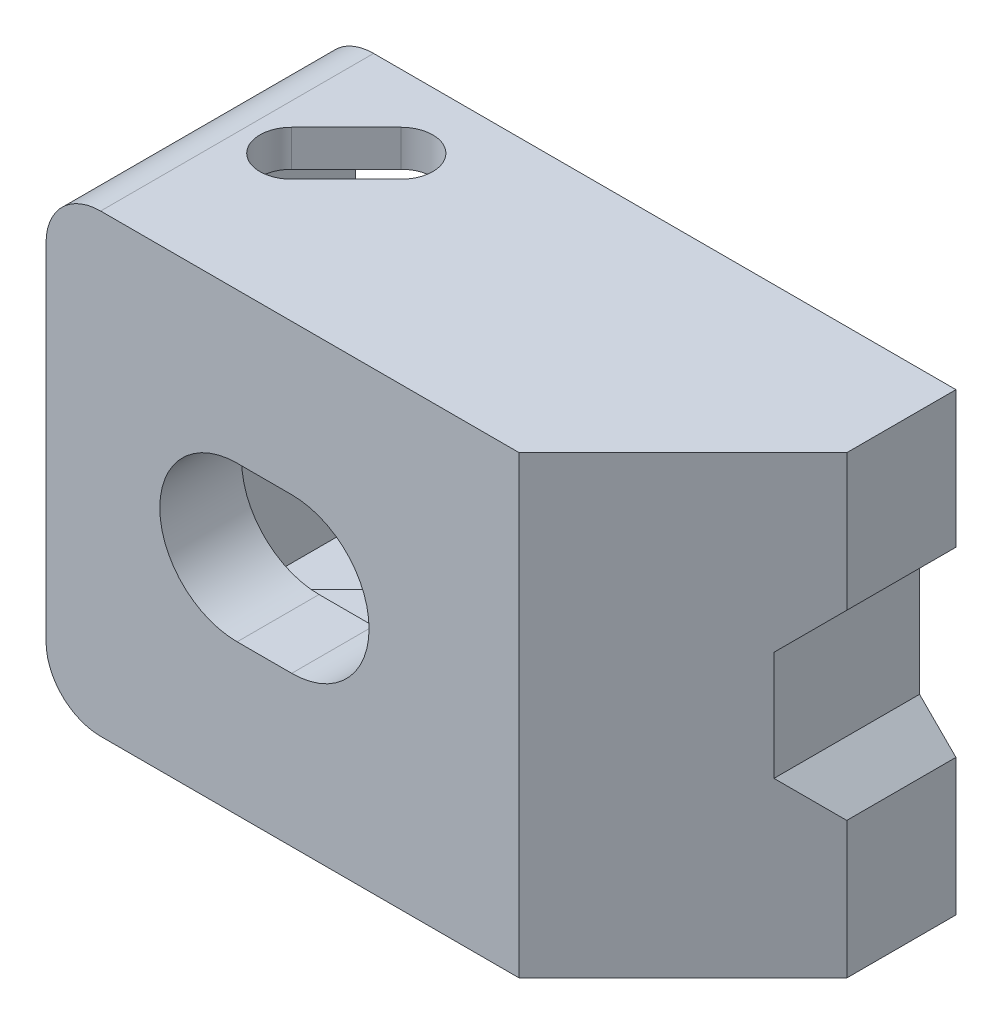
ISO-10303-21;
HEADER;
FILE_DESCRIPTION(('STEP AP214'),'2;1');
FILE_NAME('part.step','',(''),(''),'','','');
FILE_SCHEMA(('AUTOMOTIVE_DESIGN { 1 0 10303 214 1 1 1 1 }'));
ENDSEC;
DATA;
#1=APPLICATION_CONTEXT('core data for automotive mechanical design processes');
#2=APPLICATION_PROTOCOL_DEFINITION('international standard','automotive_design',2000,#1);
#3=PRODUCT_CONTEXT('',#1,'mechanical');
#4=PRODUCT('Part','Part','',(#3));
#5=PRODUCT_RELATED_PRODUCT_CATEGORY('part','',(#4));
#6=PRODUCT_DEFINITION_FORMATION('','',#4);
#7=PRODUCT_DEFINITION_CONTEXT('part definition',#1,'design');
#8=PRODUCT_DEFINITION('design','',#6,#7);
#9=PRODUCT_DEFINITION_SHAPE('','',#8);
#10=(LENGTH_UNIT() NAMED_UNIT(*) SI_UNIT(.MILLI.,.METRE.));
#11=(NAMED_UNIT(*) PLANE_ANGLE_UNIT() SI_UNIT($,.RADIAN.));
#12=(NAMED_UNIT(*) SI_UNIT($,.STERADIAN.) SOLID_ANGLE_UNIT());
#13=UNCERTAINTY_MEASURE_WITH_UNIT(LENGTH_MEASURE(1.E-05),#10,'distance_accuracy_value','');
#14=(GEOMETRIC_REPRESENTATION_CONTEXT(3) GLOBAL_UNCERTAINTY_ASSIGNED_CONTEXT((#13)) GLOBAL_UNIT_ASSIGNED_CONTEXT((#10,
#11,#12)) REPRESENTATION_CONTEXT('',''));
#15=CARTESIAN_POINT('',(0.,0.,0.));
#16=DIRECTION('',(0.,0.,1.));
#17=DIRECTION('',(1.,0.,0.));
#18=AXIS2_PLACEMENT_3D('',#15,#16,#17);
#19=CARTESIAN_POINT('',(18.5,-12.5,25.));
#20=DIRECTION('',(0.,1.,0.));
#21=DIRECTION('',(0.,0.,-1.));
#22=AXIS2_PLACEMENT_3D('',#19,#20,#21);
#23=PLANE('',#22);
#24=DIRECTION('',(1.,0.,0.));
#25=VECTOR('',#24,1.);
#26=CARTESIAN_POINT('',(0.500000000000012,-12.5,15.));
#27=LINE('',#26,#25);
#28=CARTESIAN_POINT('',(-10.5,-12.5,15.));
#29=VERTEX_POINT('',#28);
#30=CARTESIAN_POINT('',(12.5,-12.5,15.));
#31=VERTEX_POINT('',#30);
#32=EDGE_CURVE('E353',#29,#31,#27,.T.);
#33=ORIENTED_EDGE('',*,*,#32,.F.);
#34=DIRECTION('',(0.,0.,1.));
#35=VECTOR('',#34,1.);
#36=CARTESIAN_POINT('',(-10.5,-12.5,25.));
#37=LINE('',#36,#35);
#38=CARTESIAN_POINT('',(-10.5,-12.5,0.));
#39=VERTEX_POINT('',#38);
#40=EDGE_CURVE('E37',#29,#39,#37,.F.);
#41=ORIENTED_EDGE('',*,*,#40,.T.);
#42=DIRECTION('',(1.,0.,0.));
#43=VECTOR('',#42,1.);
#44=CARTESIAN_POINT('',(18.5,-12.5,0.));
#45=LINE('',#44,#43);
#46=CARTESIAN_POINT('',(21.5,-12.5,0.));
#47=VERTEX_POINT('',#46);
#48=EDGE_CURVE('E339',#39,#47,#45,.T.);
#49=ORIENTED_EDGE('',*,*,#48,.T.);
#50=DIRECTION('',(0.,0.,1.));
#51=VECTOR('',#50,1.);
#52=CARTESIAN_POINT('',(21.5,-12.5,-25.1793566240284));
#53=LINE('',#52,#51);
#54=CARTESIAN_POINT('',(21.5,-12.5,6.));
#55=VERTEX_POINT('',#54);
#56=EDGE_CURVE('E285',#47,#55,#53,.T.);
#57=ORIENTED_EDGE('',*,*,#56,.T.);
#58=DIRECTION('',(-0.707106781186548,0.,0.707106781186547));
#59=VECTOR('',#58,1.);
#60=CARTESIAN_POINT('',(21.5,-12.5,6.));
#61=LINE('',#60,#59);
#62=EDGE_CURVE('E271',#55,#31,#61,.T.);
#63=ORIENTED_EDGE('',*,*,#62,.T.);
#64=EDGE_LOOP('',(#33,#41,#49,#57,#63));
#65=FACE_BOUND('',#64,.T.);
#66=CARTESIAN_POINT('',(-8.,-12.5,7.));
#67=DIRECTION('',(0.,1.,0.));
#68=DIRECTION('',(0.,0.,-1.));
#69=AXIS2_PLACEMENT_3D('',#66,#67,#68);
#70=CIRCLE('',#69,1.75);
#71=CARTESIAN_POINT('',(-9.23743686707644,-12.5,5.76256313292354));
#72=VERTEX_POINT('',#71);
#73=CARTESIAN_POINT('',(-6.76256313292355,-12.5,8.23743686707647));
#74=VERTEX_POINT('',#73);
#75=EDGE_CURVE('E702',#72,#74,#70,.T.);
#76=ORIENTED_EDGE('',*,*,#75,.T.);
#77=DIRECTION('',(0.707106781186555,0.,-0.70710678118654));
#78=VECTOR('',#77,1.);
#79=CARTESIAN_POINT('',(-6.76256313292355,-12.5,8.23743686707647));
#80=LINE('',#79,#78);
#81=CARTESIAN_POINT('',(-3.76256313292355,-12.5,5.23743686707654));
#82=VERTEX_POINT('',#81);
#83=EDGE_CURVE('E689',#74,#82,#80,.T.);
#84=ORIENTED_EDGE('',*,*,#83,.T.);
#85=CARTESIAN_POINT('',(-5.,-12.5,4.00000000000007));
#86=DIRECTION('',(0.,1.,0.));
#87=DIRECTION('',(0.,0.,-1.));
#88=AXIS2_PLACEMENT_3D('',#85,#86,#87);
#89=CIRCLE('',#88,1.75);
#90=CARTESIAN_POINT('',(-6.23743686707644,-12.5,2.7625631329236));
#91=VERTEX_POINT('',#90);
#92=EDGE_CURVE('E694',#82,#91,#89,.T.);
#93=ORIENTED_EDGE('',*,*,#92,.T.);
#94=DIRECTION('',(-0.707106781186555,0.,0.707106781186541));
#95=VECTOR('',#94,1.);
#96=CARTESIAN_POINT('',(-9.23743686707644,-12.5,5.76256313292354));
#97=LINE('',#96,#95);
#98=EDGE_CURVE('E698',#91,#72,#97,.T.);
#99=ORIENTED_EDGE('',*,*,#98,.T.);
#100=EDGE_LOOP('',(#76,#84,#93,#99));
#101=FACE_BOUND('',#100,.T.);
#102=ADVANCED_FACE('F14',(#65,#101),#23,.F.);
#103=CARTESIAN_POINT('',(-11.5,-10.5,0.));
#104=DIRECTION('',(0.,1.,0.));
#105=DIRECTION('',(0.,0.,-1.));
#106=AXIS2_PLACEMENT_3D('',#103,#104,#105);
#107=PLANE('',#106);
#108=DIRECTION('',(-1.,0.,0.));
#109=VECTOR('',#108,1.);
#110=CARTESIAN_POINT('',(-11.5,-10.5,0.));
#111=LINE('',#110,#109);
#112=CARTESIAN_POINT('',(15.727922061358,-10.5,0.));
#113=VERTEX_POINT('',#112);
#114=CARTESIAN_POINT('',(-11.5,-10.5,0.));
#115=VERTEX_POINT('',#114);
#116=EDGE_CURVE('E370',#113,#115,#111,.T.);
#117=ORIENTED_EDGE('',*,*,#116,.T.);
#118=DIRECTION('',(0.,0.,1.));
#119=VECTOR('',#118,1.);
#120=CARTESIAN_POINT('',(-11.5,-10.5,12.));
#121=LINE('',#120,#119);
#122=CARTESIAN_POINT('',(-11.5,-10.5,12.));
#123=VERTEX_POINT('',#122);
#124=EDGE_CURVE('E379',#115,#123,#121,.T.);
#125=ORIENTED_EDGE('',*,*,#124,.T.);
#126=DIRECTION('',(1.,0.,0.));
#127=VECTOR('',#126,1.);
#128=CARTESIAN_POINT('',(-9.,-10.5,12.));
#129=LINE('',#128,#127);
#130=CARTESIAN_POINT('',(-9.,-10.5,12.));
#131=VERTEX_POINT('',#130);
#132=EDGE_CURVE('E384',#123,#131,#129,.T.);
#133=ORIENTED_EDGE('',*,*,#132,.T.);
#134=DIRECTION('',(0.70710678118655,0.,-0.707106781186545));
#135=VECTOR('',#134,1.);
#136=CARTESIAN_POINT('',(-3.,-10.5,6.));
#137=LINE('',#136,#135);
#138=CARTESIAN_POINT('',(-3.,-10.5,6.));
#139=VERTEX_POINT('',#138);
#140=EDGE_CURVE('E473',#131,#139,#137,.T.);
#141=ORIENTED_EDGE('',*,*,#140,.T.);
#142=DIRECTION('',(1.,0.,0.));
#143=VECTOR('',#142,1.);
#144=CARTESIAN_POINT('',(9.72792206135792,-10.5,6.));
#145=LINE('',#144,#143);
#146=CARTESIAN_POINT('',(9.72792206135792,-10.5,6.));
#147=VERTEX_POINT('',#146);
#148=EDGE_CURVE('E471',#139,#147,#145,.T.);
#149=ORIENTED_EDGE('',*,*,#148,.T.);
#150=DIRECTION('',(0.70710678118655,0.,-0.707106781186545));
#151=VECTOR('',#150,1.);
#152=CARTESIAN_POINT('',(15.727922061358,-10.5,0.));
#153=LINE('',#152,#151);
#154=EDGE_CURVE('E382',#147,#113,#153,.T.);
#155=ORIENTED_EDGE('',*,*,#154,.T.);
#156=EDGE_LOOP('',(#117,#125,#133,#141,#149,#155));
#157=FACE_BOUND('',#156,.T.);
#158=DIRECTION('',(-0.707106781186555,0.,0.70710678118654));
#159=VECTOR('',#158,1.);
#160=CARTESIAN_POINT('',(-5.0125631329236,-10.5,6.48743686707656));
#161=LINE('',#160,#159);
#162=CARTESIAN_POINT('',(-3.76256313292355,-10.5,5.23743686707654));
#163=VERTEX_POINT('',#162);
#164=CARTESIAN_POINT('',(-6.76256313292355,-10.5,8.23743686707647));
#165=VERTEX_POINT('',#164);
#166=EDGE_CURVE('E715',#163,#165,#161,.T.);
#167=ORIENTED_EDGE('',*,*,#166,.T.);
#168=CARTESIAN_POINT('',(-8.,-10.5,7.));
#169=DIRECTION('',(0.,1.,0.));
#170=DIRECTION('',(0.,0.,-1.));
#171=AXIS2_PLACEMENT_3D('',#168,#169,#170);
#172=CIRCLE('',#171,1.75);
#173=CARTESIAN_POINT('',(-9.23743686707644,-10.5,5.76256313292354));
#174=VERTEX_POINT('',#173);
#175=EDGE_CURVE('E718',#165,#174,#172,.F.);
#176=ORIENTED_EDGE('',*,*,#175,.T.);
#177=DIRECTION('',(0.707106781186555,0.,-0.707106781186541));
#178=VECTOR('',#177,1.);
#179=CARTESIAN_POINT('',(-7.48743686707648,-10.5,4.01256313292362));
#180=LINE('',#179,#178);
#181=CARTESIAN_POINT('',(-6.23743686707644,-10.5,2.7625631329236));
#182=VERTEX_POINT('',#181);
#183=EDGE_CURVE('E701',#174,#182,#180,.T.);
#184=ORIENTED_EDGE('',*,*,#183,.T.);
#185=CARTESIAN_POINT('',(-5.,-10.5,4.00000000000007));
#186=DIRECTION('',(0.,1.,0.));
#187=DIRECTION('',(0.,0.,-1.));
#188=AXIS2_PLACEMENT_3D('',#185,#186,#187);
#189=CIRCLE('',#188,1.75);
#190=EDGE_CURVE('E712',#182,#163,#189,.F.);
#191=ORIENTED_EDGE('',*,*,#190,.T.);
#192=EDGE_LOOP('',(#167,#176,#184,#191));
#193=FACE_BOUND('',#192,.T.);
#194=ADVANCED_FACE('F376',(#157,#193),#107,.T.);
#195=CARTESIAN_POINT('',(21.5,-12.5,-25.1793566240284));
#196=DIRECTION('',(1.,0.,0.));
#197=DIRECTION('',(0.,1.,0.));
#198=AXIS2_PLACEMENT_3D('',#195,#196,#197);
#199=PLANE('',#198);
#200=DIRECTION('',(0.,1.,0.));
#201=VECTOR('',#200,1.);
#202=CARTESIAN_POINT('',(21.5,-12.5,6.));
#203=LINE('',#202,#201);
#204=CARTESIAN_POINT('',(21.5,5.,6.));
#205=VERTEX_POINT('',#204);
#206=CARTESIAN_POINT('',(21.5,12.5,6.));
#207=VERTEX_POINT('',#206);
#208=EDGE_CURVE('E258',#205,#207,#203,.T.);
#209=ORIENTED_EDGE('',*,*,#208,.F.);
#210=DIRECTION('',(0.,0.,1.));
#211=VECTOR('',#210,1.);
#212=CARTESIAN_POINT('',(21.5,5.,-25.1793566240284));
#213=LINE('',#212,#211);
#214=CARTESIAN_POINT('',(21.5,5.,0.));
#215=VERTEX_POINT('',#214);
#216=EDGE_CURVE('E319',#215,#205,#213,.T.);
#217=ORIENTED_EDGE('',*,*,#216,.F.);
#218=DIRECTION('',(0.,-1.,0.));
#219=VECTOR('',#218,1.);
#220=CARTESIAN_POINT('',(21.5,-12.5,0.));
#221=LINE('',#220,#219);
#222=CARTESIAN_POINT('',(21.5,12.5,0.));
#223=VERTEX_POINT('',#222);
#224=EDGE_CURVE('E283',#223,#215,#221,.T.);
#225=ORIENTED_EDGE('',*,*,#224,.F.);
#226=DIRECTION('',(0.,0.,1.));
#227=VECTOR('',#226,1.);
#228=CARTESIAN_POINT('',(21.5,12.5,-25.1793566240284));
#229=LINE('',#228,#227);
#230=EDGE_CURVE('E276',#223,#207,#229,.T.);
#231=ORIENTED_EDGE('',*,*,#230,.T.);
#232=EDGE_LOOP('',(#209,#217,#225,#231));
#233=FACE_BOUND('',#232,.T.);
#234=ADVANCED_FACE('F281',(#233),#199,.T.);
#235=CARTESIAN_POINT('',(0.,0.,10.5));
#236=DIRECTION('',(0.,0.,-1.));
#237=DIRECTION('',(1.,0.,0.));
#238=AXIS2_PLACEMENT_3D('',#235,#236,#237);
#239=CYLINDRICAL_SURFACE('',#238,6.25);
#240=DIRECTION('',(0.,0.,-1.));
#241=VECTOR('',#240,1.);
#242=CARTESIAN_POINT('',(5.,3.75,10.5));
#243=LINE('',#242,#241);
#244=CARTESIAN_POINT('',(5.,3.75,10.5));
#245=VERTEX_POINT('',#244);
#246=CARTESIAN_POINT('',(5.,3.75,6.));
#247=VERTEX_POINT('',#246);
#248=EDGE_CURVE('E357',#245,#247,#243,.T.);
#249=ORIENTED_EDGE('',*,*,#248,.F.);
#250=CARTESIAN_POINT('',(0.,0.,10.5));
#251=DIRECTION('',(0.,0.,-1.));
#252=DIRECTION('',(1.,0.,0.));
#253=AXIS2_PLACEMENT_3D('',#250,#251,#252);
#254=CIRCLE('',#253,6.25);
#255=CARTESIAN_POINT('',(0.,6.25,10.5));
#256=VERTEX_POINT('',#255);
#257=EDGE_CURVE('E438',#256,#245,#254,.T.);
#258=ORIENTED_EDGE('',*,*,#257,.F.);
#259=DIRECTION('',(0.,0.,-1.));
#260=VECTOR('',#259,1.);
#261=CARTESIAN_POINT('',(0.,6.25,10.5));
#262=LINE('',#261,#260);
#263=CARTESIAN_POINT('',(0.,6.25,6.));
#264=VERTEX_POINT('',#263);
#265=EDGE_CURVE('E430',#256,#264,#262,.T.);
#266=ORIENTED_EDGE('',*,*,#265,.T.);
#267=CARTESIAN_POINT('',(0.,0.,6.));
#268=DIRECTION('',(0.,0.,1.));
#269=DIRECTION('',(-1.,0.,0.));
#270=AXIS2_PLACEMENT_3D('',#267,#268,#269);
#271=CIRCLE('',#270,6.25);
#272=EDGE_CURVE('E394',#264,#247,#271,.F.);
#273=ORIENTED_EDGE('',*,*,#272,.T.);
#274=EDGE_LOOP('',(#249,#258,#266,#273));
#275=FACE_BOUND('',#274,.T.);
#276=ADVANCED_FACE('F550',(#275),#239,.F.);
#277=DIRECTION('',(0.,0.,-1.));
#278=VECTOR('',#277,1.);
#279=CARTESIAN_POINT('',(5.,-3.75,10.5));
#280=LINE('',#279,#278);
#281=CARTESIAN_POINT('',(5.,-3.75,6.));
#282=VERTEX_POINT('',#281);
#283=CARTESIAN_POINT('',(5.,-3.75,10.5));
#284=VERTEX_POINT('',#283);
#285=EDGE_CURVE('E535',#282,#284,#280,.F.);
#286=ORIENTED_EDGE('',*,*,#285,.F.);
#287=CARTESIAN_POINT('',(0.,-6.25,6.));
#288=VERTEX_POINT('',#287);
#289=EDGE_CURVE('E397',#282,#288,#271,.F.);
#290=ORIENTED_EDGE('',*,*,#289,.T.);
#291=DIRECTION('',(0.,0.,-1.));
#292=VECTOR('',#291,1.);
#293=CARTESIAN_POINT('',(0.,-6.25,10.5));
#294=LINE('',#293,#292);
#295=CARTESIAN_POINT('',(0.,-6.25,10.5));
#296=VERTEX_POINT('',#295);
#297=EDGE_CURVE('E429',#296,#288,#294,.T.);
#298=ORIENTED_EDGE('',*,*,#297,.F.);
#299=EDGE_CURVE('E441',#284,#296,#254,.T.);
#300=ORIENTED_EDGE('',*,*,#299,.F.);
#301=EDGE_LOOP('',(#286,#290,#298,#300));
#302=FACE_BOUND('',#301,.T.);
#303=ADVANCED_FACE('F548',(#302),#239,.F.);
#304=CARTESIAN_POINT('',(9.72792206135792,-10.5,6.));
#305=DIRECTION('',(0.,0.,1.));
#306=DIRECTION('',(-1.,0.,0.));
#307=AXIS2_PLACEMENT_3D('',#304,#305,#306);
#308=PLANE('',#307);
#309=DIRECTION('',(1.,0.,0.));
#310=VECTOR('',#309,1.);
#311=CARTESIAN_POINT('',(9.72792206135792,3.75,6.));
#312=LINE('',#311,#310);
#313=CARTESIAN_POINT('',(9.72792206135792,3.75,6.));
#314=VERTEX_POINT('',#313);
#315=EDGE_CURVE('E360',#247,#314,#312,.T.);
#316=ORIENTED_EDGE('',*,*,#315,.F.);
#317=ORIENTED_EDGE('',*,*,#272,.F.);
#318=DIRECTION('',(1.,0.,0.));
#319=VECTOR('',#318,1.);
#320=CARTESIAN_POINT('',(-11.5,6.25,6.));
#321=LINE('',#320,#319);
#322=CARTESIAN_POINT('',(-3.,6.25,6.));
#323=VERTEX_POINT('',#322);
#324=EDGE_CURVE('E449',#323,#264,#321,.T.);
#325=ORIENTED_EDGE('',*,*,#324,.F.);
#326=DIRECTION('',(0.,1.,0.));
#327=VECTOR('',#326,1.);
#328=CARTESIAN_POINT('',(-3.,-10.5,6.));
#329=LINE('',#328,#327);
#330=CARTESIAN_POINT('',(-3.,10.5,6.));
#331=VERTEX_POINT('',#330);
#332=EDGE_CURVE('E461',#323,#331,#329,.T.);
#333=ORIENTED_EDGE('',*,*,#332,.T.);
#334=DIRECTION('',(1.,0.,0.));
#335=VECTOR('',#334,1.);
#336=CARTESIAN_POINT('',(9.72792206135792,10.5,6.));
#337=LINE('',#336,#335);
#338=CARTESIAN_POINT('',(9.72792206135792,10.5,6.));
#339=VERTEX_POINT('',#338);
#340=EDGE_CURVE('E387',#331,#339,#337,.T.);
#341=ORIENTED_EDGE('',*,*,#340,.T.);
#342=DIRECTION('',(0.,1.,0.));
#343=VECTOR('',#342,1.);
#344=CARTESIAN_POINT('',(9.72792206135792,-10.5,6.));
#345=LINE('',#344,#343);
#346=EDGE_CURVE('E465',#314,#339,#345,.T.);
#347=ORIENTED_EDGE('',*,*,#346,.F.);
#348=EDGE_LOOP('',(#316,#317,#325,#333,#341,#347));
#349=FACE_BOUND('',#348,.T.);
#350=ADVANCED_FACE('F496',(#349),#308,.F.);
#351=DIRECTION('',(-1.,0.,0.));
#352=VECTOR('',#351,1.);
#353=CARTESIAN_POINT('',(9.72792206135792,-3.75,6.));
#354=LINE('',#353,#352);
#355=CARTESIAN_POINT('',(9.72792206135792,-3.75,6.));
#356=VERTEX_POINT('',#355);
#357=EDGE_CURVE('E532',#356,#282,#354,.T.);
#358=ORIENTED_EDGE('',*,*,#357,.F.);
#359=EDGE_CURVE('E466',#147,#356,#345,.T.);
#360=ORIENTED_EDGE('',*,*,#359,.F.);
#361=ORIENTED_EDGE('',*,*,#148,.F.);
#362=CARTESIAN_POINT('',(-3.,-6.25,6.));
#363=VERTEX_POINT('',#362);
#364=EDGE_CURVE('E462',#139,#363,#329,.T.);
#365=ORIENTED_EDGE('',*,*,#364,.T.);
#366=DIRECTION('',(-1.,0.,0.));
#367=VECTOR('',#366,1.);
#368=CARTESIAN_POINT('',(-11.5,-6.25,6.));
#369=LINE('',#368,#367);
#370=EDGE_CURVE('E452',#288,#363,#369,.T.);
#371=ORIENTED_EDGE('',*,*,#370,.F.);
#372=ORIENTED_EDGE('',*,*,#289,.F.);
#373=EDGE_LOOP('',(#358,#360,#361,#365,#371,#372));
#374=FACE_BOUND('',#373,.T.);
#375=ADVANCED_FACE('F514',(#374),#308,.F.);
#376=CARTESIAN_POINT('',(15.727922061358,-10.5,0.));
#377=DIRECTION('',(0.707106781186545,0.,0.70710678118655));
#378=DIRECTION('',(-0.70710678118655,0.,0.707106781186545));
#379=AXIS2_PLACEMENT_3D('',#376,#377,#378);
#380=PLANE('',#379);
#381=DIRECTION('',(0.70710678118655,0.,-0.707106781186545));
#382=VECTOR('',#381,1.);
#383=CARTESIAN_POINT('',(15.727922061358,3.75,0.));
#384=LINE('',#383,#382);
#385=CARTESIAN_POINT('',(10.,3.75,5.72792206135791));
#386=VERTEX_POINT('',#385);
#387=EDGE_CURVE('E315',#314,#386,#384,.T.);
#388=ORIENTED_EDGE('',*,*,#387,.F.);
#389=ORIENTED_EDGE('',*,*,#346,.T.);
#390=DIRECTION('',(0.70710678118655,0.,-0.707106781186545));
#391=VECTOR('',#390,1.);
#392=CARTESIAN_POINT('',(15.727922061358,10.5,0.));
#393=LINE('',#392,#391);
#394=CARTESIAN_POINT('',(15.727922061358,10.5,0.));
#395=VERTEX_POINT('',#394);
#396=EDGE_CURVE('E383',#339,#395,#393,.T.);
#397=ORIENTED_EDGE('',*,*,#396,.T.);
#398=DIRECTION('',(0.,1.,0.));
#399=VECTOR('',#398,1.);
#400=CARTESIAN_POINT('',(15.727922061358,-10.5,0.));
#401=LINE('',#400,#399);
#402=EDGE_CURVE('E455',#113,#395,#401,.T.);
#403=ORIENTED_EDGE('',*,*,#402,.F.);
#404=ORIENTED_EDGE('',*,*,#154,.F.);
#405=ORIENTED_EDGE('',*,*,#359,.T.);
#406=DIRECTION('',(-0.70710678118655,0.,0.707106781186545));
#407=VECTOR('',#406,1.);
#408=CARTESIAN_POINT('',(15.727922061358,-3.75,0.));
#409=LINE('',#408,#407);
#410=CARTESIAN_POINT('',(10.,-3.75,5.72792206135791));
#411=VERTEX_POINT('',#410);
#412=EDGE_CURVE('E309',#411,#356,#409,.T.);
#413=ORIENTED_EDGE('',*,*,#412,.F.);
#414=CARTESIAN_POINT('',(10.,0.,5.72792206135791));
#415=DIRECTION('',(0.707106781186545,0.,0.70710678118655));
#416=DIRECTION('',(0.70710678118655,0.,-0.707106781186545));
#417=AXIS2_PLACEMENT_3D('',#414,#415,#416);
#418=ELLIPSE('',#417,5.30330085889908,3.75);
#419=EDGE_CURVE('E311',#386,#411,#418,.F.);
#420=ORIENTED_EDGE('',*,*,#419,.F.);
#421=EDGE_LOOP('',(#388,#389,#397,#403,#404,#405,#413,#420));
#422=FACE_BOUND('',#421,.T.);
#423=ADVANCED_FACE('F518',(#422),#380,.F.);
#424=CARTESIAN_POINT('',(18.5,12.5,0.));
#425=DIRECTION('',(0.,0.,1.));
#426=DIRECTION('',(-1.,0.,0.));
#427=AXIS2_PLACEMENT_3D('',#424,#425,#426);
#428=PLANE('',#427);
#429=ORIENTED_EDGE('',*,*,#48,.F.);
#430=CARTESIAN_POINT('',(-10.5,-9.5,0.));
#431=DIRECTION('',(0.,0.,1.));
#432=DIRECTION('',(-1.,0.,0.));
#433=AXIS2_PLACEMENT_3D('',#430,#431,#432);
#434=CIRCLE('',#433,3.);
#435=CARTESIAN_POINT('',(-13.5,-9.5,0.));
#436=VERTEX_POINT('',#435);
#437=EDGE_CURVE('E22',#39,#436,#434,.F.);
#438=ORIENTED_EDGE('',*,*,#437,.T.);
#439=DIRECTION('',(0.,-1.,0.));
#440=VECTOR('',#439,1.);
#441=CARTESIAN_POINT('',(-13.5,12.5,0.));
#442=LINE('',#441,#440);
#443=CARTESIAN_POINT('',(-13.5,9.5,0.));
#444=VERTEX_POINT('',#443);
#445=EDGE_CURVE('E290',#444,#436,#442,.T.);
#446=ORIENTED_EDGE('',*,*,#445,.F.);
#447=CARTESIAN_POINT('',(-10.5,9.5,0.));
#448=DIRECTION('',(0.,0.,1.));
#449=DIRECTION('',(-1.,0.,0.));
#450=AXIS2_PLACEMENT_3D('',#447,#448,#449);
#451=CIRCLE('',#450,3.);
#452=CARTESIAN_POINT('',(-10.5,12.5,0.));
#453=VERTEX_POINT('',#452);
#454=EDGE_CURVE('E29',#444,#453,#451,.F.);
#455=ORIENTED_EDGE('',*,*,#454,.T.);
#456=DIRECTION('',(-1.,0.,0.));
#457=VECTOR('',#456,1.);
#458=CARTESIAN_POINT('',(18.5,12.5,0.));
#459=LINE('',#458,#457);
#460=EDGE_CURVE('E401',#223,#453,#459,.T.);
#461=ORIENTED_EDGE('',*,*,#460,.F.);
#462=ORIENTED_EDGE('',*,*,#224,.T.);
#463=DIRECTION('',(-0.707106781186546,-0.707106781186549,0.));
#464=VECTOR('',#463,1.);
#465=CARTESIAN_POINT('',(23.75,7.25,0.));
#466=LINE('',#465,#464);
#467=CARTESIAN_POINT('',(19.5,3.,0.));
#468=VERTEX_POINT('',#467);
#469=EDGE_CURVE('E730',#215,#468,#466,.T.);
#470=ORIENTED_EDGE('',*,*,#469,.T.);
#471=DIRECTION('',(0.,-1.,0.));
#472=VECTOR('',#471,1.);
#473=CARTESIAN_POINT('',(19.5,12.5,0.));
#474=LINE('',#473,#472);
#475=CARTESIAN_POINT('',(19.5,-3.,0.));
#476=VERTEX_POINT('',#475);
#477=EDGE_CURVE('E733',#468,#476,#474,.T.);
#478=ORIENTED_EDGE('',*,*,#477,.T.);
#479=DIRECTION('',(0.707106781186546,-0.707106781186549,0.));
#480=VECTOR('',#479,1.);
#481=CARTESIAN_POINT('',(11.25,5.25,0.));
#482=LINE('',#481,#480);
#483=CARTESIAN_POINT('',(21.5,-5.,0.));
#484=VERTEX_POINT('',#483);
#485=EDGE_CURVE('E725',#476,#484,#482,.T.);
#486=ORIENTED_EDGE('',*,*,#485,.T.);
#487=EDGE_CURVE('E284',#484,#47,#221,.T.);
#488=ORIENTED_EDGE('',*,*,#487,.T.);
#489=EDGE_LOOP('',(#429,#438,#446,#455,#461,#462,#470,#478,#486,#488));
#490=FACE_BOUND('',#489,.T.);
#491=ORIENTED_EDGE('',*,*,#116,.F.);
#492=ORIENTED_EDGE('',*,*,#402,.T.);
#493=DIRECTION('',(-1.,0.,0.));
#494=VECTOR('',#493,1.);
#495=CARTESIAN_POINT('',(-11.5,10.5,0.));
#496=LINE('',#495,#494);
#497=CARTESIAN_POINT('',(-11.5,10.5,0.));
#498=VERTEX_POINT('',#497);
#499=EDGE_CURVE('E302',#395,#498,#496,.T.);
#500=ORIENTED_EDGE('',*,*,#499,.T.);
#501=DIRECTION('',(0.,-1.,0.));
#502=VECTOR('',#501,1.);
#503=CARTESIAN_POINT('',(-11.5,12.5,0.));
#504=LINE('',#503,#502);
#505=EDGE_CURVE('E347',#498,#115,#504,.T.);
#506=ORIENTED_EDGE('',*,*,#505,.T.);
#507=EDGE_LOOP('',(#491,#492,#500,#506));
#508=FACE_BOUND('',#507,.T.);
#509=ADVANCED_FACE('F337',(#490,#508),#428,.F.);
#510=CARTESIAN_POINT('',(-3.,0.,0.));
#511=DIRECTION('',(0.,0.,1.));
#512=DIRECTION('',(-1.,0.,0.));
#513=AXIS2_PLACEMENT_3D('',#510,#511,#512);
#514=CYLINDRICAL_SURFACE('',#513,4.25);
#515=CARTESIAN_POINT('',(-3.,0.,10.5));
#516=DIRECTION('',(0.,0.,-1.));
#517=DIRECTION('',(1.,0.,0.));
#518=AXIS2_PLACEMENT_3D('',#515,#516,#517);
#519=CIRCLE('',#518,4.25);
#520=CARTESIAN_POINT('',(-3.,4.25,10.5));
#521=VERTEX_POINT('',#520);
#522=CARTESIAN_POINT('',(-3.,-4.25,10.5));
#523=VERTEX_POINT('',#522);
#524=EDGE_CURVE('E423',#521,#523,#519,.F.);
#525=ORIENTED_EDGE('',*,*,#524,.F.);
#526=DIRECTION('',(0.,0.,1.));
#527=VECTOR('',#526,1.);
#528=CARTESIAN_POINT('',(-3.,4.25,0.));
#529=LINE('',#528,#527);
#530=CARTESIAN_POINT('',(-3.,4.25,15.));
#531=VERTEX_POINT('',#530);
#532=EDGE_CURVE('E403',#521,#531,#529,.T.);
#533=ORIENTED_EDGE('',*,*,#532,.T.);
#534=CARTESIAN_POINT('',(-3.,0.,15.));
#535=DIRECTION('',(0.,0.,1.));
#536=DIRECTION('',(1.,0.,0.));
#537=AXIS2_PLACEMENT_3D('',#534,#535,#536);
#538=CIRCLE('',#537,4.25);
#539=CARTESIAN_POINT('',(-3.,-4.25,15.));
#540=VERTEX_POINT('',#539);
#541=EDGE_CURVE('E420',#531,#540,#538,.T.);
#542=ORIENTED_EDGE('',*,*,#541,.T.);
#543=DIRECTION('',(0.,0.,1.));
#544=VECTOR('',#543,1.);
#545=CARTESIAN_POINT('',(-3.,-4.25,0.));
#546=LINE('',#545,#544);
#547=EDGE_CURVE('E404',#523,#540,#546,.T.);
#548=ORIENTED_EDGE('',*,*,#547,.F.);
#549=EDGE_LOOP('',(#525,#533,#542,#548));
#550=FACE_BOUND('',#549,.T.);
#551=ADVANCED_FACE('F571',(#550),#514,.F.);
#552=CARTESIAN_POINT('',(-3.,4.25,0.));
#553=DIRECTION('',(0.,1.,0.));
#554=DIRECTION('',(0.,0.,-1.));
#555=AXIS2_PLACEMENT_3D('',#552,#553,#554);
#556=PLANE('',#555);
#557=DIRECTION('',(-1.,0.,0.));
#558=VECTOR('',#557,1.);
#559=CARTESIAN_POINT('',(-3.,4.25,10.5));
#560=LINE('',#559,#558);
#561=CARTESIAN_POINT('',(0.,4.25,10.5));
#562=VERTEX_POINT('',#561);
#563=EDGE_CURVE('E425',#562,#521,#560,.T.);
#564=ORIENTED_EDGE('',*,*,#563,.F.);
#565=DIRECTION('',(0.,0.,1.));
#566=VECTOR('',#565,1.);
#567=CARTESIAN_POINT('',(0.,4.25,0.));
#568=LINE('',#567,#566);
#569=CARTESIAN_POINT('',(0.,4.25,15.));
#570=VERTEX_POINT('',#569);
#571=EDGE_CURVE('E409',#562,#570,#568,.T.);
#572=ORIENTED_EDGE('',*,*,#571,.T.);
#573=DIRECTION('',(-1.,0.,0.));
#574=VECTOR('',#573,1.);
#575=CARTESIAN_POINT('',(-3.,4.25,15.));
#576=LINE('',#575,#574);
#577=EDGE_CURVE('E407',#570,#531,#576,.T.);
#578=ORIENTED_EDGE('',*,*,#577,.T.);
#579=ORIENTED_EDGE('',*,*,#532,.F.);
#580=EDGE_LOOP('',(#564,#572,#578,#579));
#581=FACE_BOUND('',#580,.T.);
#582=ADVANCED_FACE('F576',(#581),#556,.F.);
#583=CARTESIAN_POINT('',(0.,0.,0.));
#584=DIRECTION('',(0.,0.,1.));
#585=DIRECTION('',(-1.,0.,0.));
#586=AXIS2_PLACEMENT_3D('',#583,#584,#585);
#587=CYLINDRICAL_SURFACE('',#586,4.25);
#588=CARTESIAN_POINT('',(0.,0.,10.5));
#589=DIRECTION('',(0.,0.,-1.));
#590=DIRECTION('',(1.,0.,0.));
#591=AXIS2_PLACEMENT_3D('',#588,#589,#590);
#592=CIRCLE('',#591,4.25);
#593=CARTESIAN_POINT('',(0.,-4.25,10.5));
#594=VERTEX_POINT('',#593);
#595=EDGE_CURVE('E427',#594,#562,#592,.F.);
#596=ORIENTED_EDGE('',*,*,#595,.F.);
#597=DIRECTION('',(0.,0.,1.));
#598=VECTOR('',#597,1.);
#599=CARTESIAN_POINT('',(0.,-4.25,0.));
#600=LINE('',#599,#598);
#601=CARTESIAN_POINT('',(0.,-4.25,15.));
#602=VERTEX_POINT('',#601);
#603=EDGE_CURVE('E406',#594,#602,#600,.T.);
#604=ORIENTED_EDGE('',*,*,#603,.T.);
#605=CARTESIAN_POINT('',(0.,0.,15.));
#606=DIRECTION('',(0.,0.,1.));
#607=DIRECTION('',(-1.,0.,0.));
#608=AXIS2_PLACEMENT_3D('',#605,#606,#607);
#609=CIRCLE('',#608,4.25);
#610=EDGE_CURVE('E415',#602,#570,#609,.T.);
#611=ORIENTED_EDGE('',*,*,#610,.T.);
#612=ORIENTED_EDGE('',*,*,#571,.F.);
#613=EDGE_LOOP('',(#596,#604,#611,#612));
#614=FACE_BOUND('',#613,.T.);
#615=ADVANCED_FACE('F581',(#614),#587,.F.);
#616=CARTESIAN_POINT('',(-3.,-4.25,0.));
#617=DIRECTION('',(0.,-1.,0.));
#618=DIRECTION('',(0.,0.,1.));
#619=AXIS2_PLACEMENT_3D('',#616,#617,#618);
#620=PLANE('',#619);
#621=DIRECTION('',(1.,0.,0.));
#622=VECTOR('',#621,1.);
#623=CARTESIAN_POINT('',(-3.,-4.25,10.5));
#624=LINE('',#623,#622);
#625=EDGE_CURVE('E398',#523,#594,#624,.T.);
#626=ORIENTED_EDGE('',*,*,#625,.F.);
#627=ORIENTED_EDGE('',*,*,#547,.T.);
#628=DIRECTION('',(1.,0.,0.));
#629=VECTOR('',#628,1.);
#630=CARTESIAN_POINT('',(-3.,-4.25,15.));
#631=LINE('',#630,#629);
#632=EDGE_CURVE('E417',#540,#602,#631,.T.);
#633=ORIENTED_EDGE('',*,*,#632,.T.);
#634=ORIENTED_EDGE('',*,*,#603,.F.);
#635=EDGE_LOOP('',(#626,#627,#633,#634));
#636=FACE_BOUND('',#635,.T.);
#637=ADVANCED_FACE('F578',(#636),#620,.F.);
#638=CARTESIAN_POINT('',(18.5,12.5,25.));
#639=DIRECTION('',(0.,-1.,0.));
#640=DIRECTION('',(0.,0.,1.));
#641=AXIS2_PLACEMENT_3D('',#638,#639,#640);
#642=PLANE('',#641);
#643=DIRECTION('',(0.707106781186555,0.,-0.70710678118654));
#644=VECTOR('',#643,1.);
#645=CARTESIAN_POINT('',(-6.76256313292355,12.5,8.23743686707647));
#646=LINE('',#645,#644);
#647=CARTESIAN_POINT('',(-6.76256313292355,12.5,8.23743686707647));
#648=VERTEX_POINT('',#647);
#649=CARTESIAN_POINT('',(-3.76256313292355,12.5,5.23743686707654));
#650=VERTEX_POINT('',#649);
#651=EDGE_CURVE('E747',#648,#650,#646,.T.);
#652=ORIENTED_EDGE('',*,*,#651,.F.);
#653=CARTESIAN_POINT('',(-8.,12.5,7.));
#654=DIRECTION('',(0.,1.,0.));
#655=DIRECTION('',(0.,0.,-1.));
#656=AXIS2_PLACEMENT_3D('',#653,#654,#655);
#657=CIRCLE('',#656,1.75);
#658=CARTESIAN_POINT('',(-9.23743686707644,12.5,5.76256313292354));
#659=VERTEX_POINT('',#658);
#660=EDGE_CURVE('E736',#659,#648,#657,.T.);
#661=ORIENTED_EDGE('',*,*,#660,.F.);
#662=DIRECTION('',(-0.707106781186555,0.,0.707106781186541));
#663=VECTOR('',#662,1.);
#664=CARTESIAN_POINT('',(-9.23743686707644,12.5,5.76256313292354));
#665=LINE('',#664,#663);
#666=CARTESIAN_POINT('',(-6.23743686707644,12.5,2.7625631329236));
#667=VERTEX_POINT('',#666);
#668=EDGE_CURVE('E753',#667,#659,#665,.T.);
#669=ORIENTED_EDGE('',*,*,#668,.F.);
#670=CARTESIAN_POINT('',(-5.,12.5,4.00000000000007));
#671=DIRECTION('',(0.,1.,0.));
#672=DIRECTION('',(0.,0.,-1.));
#673=AXIS2_PLACEMENT_3D('',#670,#671,#672);
#674=CIRCLE('',#673,1.75);
#675=EDGE_CURVE('E750',#650,#667,#674,.T.);
#676=ORIENTED_EDGE('',*,*,#675,.F.);
#677=EDGE_LOOP('',(#652,#661,#669,#676));
#678=FACE_BOUND('',#677,.T.);
#679=ORIENTED_EDGE('',*,*,#460,.T.);
#680=DIRECTION('',(0.,0.,-1.));
#681=VECTOR('',#680,1.);
#682=CARTESIAN_POINT('',(-10.5,12.5,25.));
#683=LINE('',#682,#681);
#684=CARTESIAN_POINT('',(-10.5,12.5,15.));
#685=VERTEX_POINT('',#684);
#686=EDGE_CURVE('E9',#453,#685,#683,.F.);
#687=ORIENTED_EDGE('',*,*,#686,.T.);
#688=DIRECTION('',(-1.,0.,0.));
#689=VECTOR('',#688,1.);
#690=CARTESIAN_POINT('',(0.500000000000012,12.5,15.));
#691=LINE('',#690,#689);
#692=CARTESIAN_POINT('',(12.5,12.5,15.));
#693=VERTEX_POINT('',#692);
#694=EDGE_CURVE('E278',#693,#685,#691,.T.);
#695=ORIENTED_EDGE('',*,*,#694,.F.);
#696=DIRECTION('',(-0.707106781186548,0.,0.707106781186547));
#697=VECTOR('',#696,1.);
#698=CARTESIAN_POINT('',(21.5,12.5,6.));
#699=LINE('',#698,#697);
#700=EDGE_CURVE('E262',#207,#693,#699,.T.);
#701=ORIENTED_EDGE('',*,*,#700,.F.);
#702=ORIENTED_EDGE('',*,*,#230,.F.);
#703=EDGE_LOOP('',(#679,#687,#695,#701,#702));
#704=FACE_BOUND('',#703,.T.);
#705=ADVANCED_FACE('F16',(#678,#704),#642,.F.);
#706=CARTESIAN_POINT('',(0.,0.,15.));
#707=DIRECTION('',(0.,0.,1.));
#708=DIRECTION('',(-1.,0.,0.));
#709=AXIS2_PLACEMENT_3D('',#706,#707,#708);
#710=PLANE('',#709);
#711=DIRECTION('',(0.,1.,0.));
#712=VECTOR('',#711,1.);
#713=CARTESIAN_POINT('',(-13.5,-12.501,15.));
#714=LINE('',#713,#712);
#715=CARTESIAN_POINT('',(-13.5,-9.5,15.));
#716=VERTEX_POINT('',#715);
#717=CARTESIAN_POINT('',(-13.5,9.5,15.));
#718=VERTEX_POINT('',#717);
#719=EDGE_CURVE('E354',#716,#718,#714,.T.);
#720=ORIENTED_EDGE('',*,*,#719,.F.);
#721=CARTESIAN_POINT('',(-10.5,-9.5,15.));
#722=DIRECTION('',(0.,0.,1.));
#723=DIRECTION('',(-1.,0.,0.));
#724=AXIS2_PLACEMENT_3D('',#721,#722,#723);
#725=CIRCLE('',#724,3.);
#726=EDGE_CURVE('E332',#716,#29,#725,.T.);
#727=ORIENTED_EDGE('',*,*,#726,.T.);
#728=ORIENTED_EDGE('',*,*,#32,.T.);
#729=DIRECTION('',(0.,1.,0.));
#730=VECTOR('',#729,1.);
#731=CARTESIAN_POINT('',(12.5,-12.5,15.));
#732=LINE('',#731,#730);
#733=EDGE_CURVE('E680',#31,#693,#732,.T.);
#734=ORIENTED_EDGE('',*,*,#733,.T.);
#735=ORIENTED_EDGE('',*,*,#694,.T.);
#736=CARTESIAN_POINT('',(-10.5,9.5,15.));
#737=DIRECTION('',(0.,0.,1.));
#738=DIRECTION('',(-1.,0.,0.));
#739=AXIS2_PLACEMENT_3D('',#736,#737,#738);
#740=CIRCLE('',#739,3.);
#741=EDGE_CURVE('E330',#685,#718,#740,.T.);
#742=ORIENTED_EDGE('',*,*,#741,.T.);
#743=EDGE_LOOP('',(#720,#727,#728,#734,#735,#742));
#744=FACE_BOUND('',#743,.T.);
#745=ORIENTED_EDGE('',*,*,#577,.F.);
#746=ORIENTED_EDGE('',*,*,#610,.F.);
#747=ORIENTED_EDGE('',*,*,#632,.F.);
#748=ORIENTED_EDGE('',*,*,#541,.F.);
#749=EDGE_LOOP('',(#745,#746,#747,#748));
#750=FACE_BOUND('',#749,.T.);
#751=ADVANCED_FACE('F351',(#744,#750),#710,.T.);
#752=CARTESIAN_POINT('',(0.,0.,10.5));
#753=DIRECTION('',(0.,0.,-1.));
#754=DIRECTION('',(1.,0.,0.));
#755=AXIS2_PLACEMENT_3D('',#752,#753,#754);
#756=PLANE('',#755);
#757=ORIENTED_EDGE('',*,*,#595,.T.);
#758=ORIENTED_EDGE('',*,*,#563,.T.);
#759=ORIENTED_EDGE('',*,*,#524,.T.);
#760=ORIENTED_EDGE('',*,*,#625,.T.);
#761=EDGE_LOOP('',(#757,#758,#759,#760));
#762=FACE_BOUND('',#761,.T.);
#763=ORIENTED_EDGE('',*,*,#257,.T.);
#764=DIRECTION('',(-1.,0.,0.));
#765=VECTOR('',#764,1.);
#766=CARTESIAN_POINT('',(10.,3.75,10.5));
#767=LINE('',#766,#765);
#768=CARTESIAN_POINT('',(10.,3.75,10.5));
#769=VERTEX_POINT('',#768);
#770=EDGE_CURVE('E547',#769,#245,#767,.T.);
#771=ORIENTED_EDGE('',*,*,#770,.F.);
#772=CARTESIAN_POINT('',(10.,0.,10.5));
#773=DIRECTION('',(0.,0.,1.));
#774=DIRECTION('',(-1.,0.,0.));
#775=AXIS2_PLACEMENT_3D('',#772,#773,#774);
#776=CIRCLE('',#775,3.75);
#777=CARTESIAN_POINT('',(10.,-3.75,10.5));
#778=VERTEX_POINT('',#777);
#779=EDGE_CURVE('E531',#778,#769,#776,.T.);
#780=ORIENTED_EDGE('',*,*,#779,.F.);
#781=DIRECTION('',(1.,0.,0.));
#782=VECTOR('',#781,1.);
#783=CARTESIAN_POINT('',(10.,-3.75,10.5));
#784=LINE('',#783,#782);
#785=EDGE_CURVE('E537',#284,#778,#784,.T.);
#786=ORIENTED_EDGE('',*,*,#785,.F.);
#787=ORIENTED_EDGE('',*,*,#299,.T.);
#788=DIRECTION('',(-1.,0.,0.));
#789=VECTOR('',#788,1.);
#790=CARTESIAN_POINT('',(-11.5,-6.25,10.5));
#791=LINE('',#790,#789);
#792=CARTESIAN_POINT('',(-7.5,-6.25,10.5));
#793=VERTEX_POINT('',#792);
#794=EDGE_CURVE('E433',#296,#793,#791,.T.);
#795=ORIENTED_EDGE('',*,*,#794,.T.);
#796=DIRECTION('',(0.,-1.,0.));
#797=VECTOR('',#796,1.);
#798=CARTESIAN_POINT('',(-7.5,0.,10.5));
#799=LINE('',#798,#797);
#800=CARTESIAN_POINT('',(-7.5,6.25,10.5));
#801=VERTEX_POINT('',#800);
#802=EDGE_CURVE('E447',#801,#793,#799,.T.);
#803=ORIENTED_EDGE('',*,*,#802,.F.);
#804=DIRECTION('',(1.,0.,0.));
#805=VECTOR('',#804,1.);
#806=CARTESIAN_POINT('',(-11.5,6.25,10.5));
#807=LINE('',#806,#805);
#808=EDGE_CURVE('E442',#801,#256,#807,.T.);
#809=ORIENTED_EDGE('',*,*,#808,.T.);
#810=EDGE_LOOP('',(#763,#771,#780,#786,#787,#795,#803,#809));
#811=FACE_BOUND('',#810,.T.);
#812=ADVANCED_FACE('F505',(#762,#811),#756,.T.);
#813=CARTESIAN_POINT('',(-11.5,6.25,10.5));
#814=DIRECTION('',(0.,1.,0.));
#815=DIRECTION('',(0.,0.,-1.));
#816=AXIS2_PLACEMENT_3D('',#813,#814,#815);
#817=PLANE('',#816);
#818=DIRECTION('',(0.70710678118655,0.,-0.707106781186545));
#819=VECTOR('',#818,1.);
#820=CARTESIAN_POINT('',(-9.5,6.25,12.5));
#821=LINE('',#820,#819);
#822=EDGE_CURVE('E444',#801,#323,#821,.T.);
#823=ORIENTED_EDGE('',*,*,#822,.T.);
#824=ORIENTED_EDGE('',*,*,#324,.T.);
#825=ORIENTED_EDGE('',*,*,#265,.F.);
#826=ORIENTED_EDGE('',*,*,#808,.F.);
#827=EDGE_LOOP('',(#823,#824,#825,#826));
#828=FACE_BOUND('',#827,.T.);
#829=ADVANCED_FACE('F501',(#828),#817,.F.);
#830=CARTESIAN_POINT('',(-11.5,-6.25,10.5));
#831=DIRECTION('',(0.,-1.,0.));
#832=DIRECTION('',(1.,0.,0.));
#833=AXIS2_PLACEMENT_3D('',#830,#831,#832);
#834=PLANE('',#833);
#835=ORIENTED_EDGE('',*,*,#297,.T.);
#836=ORIENTED_EDGE('',*,*,#370,.T.);
#837=DIRECTION('',(-0.70710678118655,0.,0.707106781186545));
#838=VECTOR('',#837,1.);
#839=CARTESIAN_POINT('',(-9.5,-6.25,12.5));
#840=LINE('',#839,#838);
#841=EDGE_CURVE('E312',#363,#793,#840,.T.);
#842=ORIENTED_EDGE('',*,*,#841,.T.);
#843=ORIENTED_EDGE('',*,*,#794,.F.);
#844=EDGE_LOOP('',(#835,#836,#842,#843));
#845=FACE_BOUND('',#844,.T.);
#846=ADVANCED_FACE('F508',(#845),#834,.F.);
#847=CARTESIAN_POINT('',(-3.,-10.5,6.));
#848=DIRECTION('',(0.707106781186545,0.,0.70710678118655));
#849=DIRECTION('',(-0.70710678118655,0.,0.707106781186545));
#850=AXIS2_PLACEMENT_3D('',#847,#848,#849);
#851=PLANE('',#850);
#852=ORIENTED_EDGE('',*,*,#802,.T.);
#853=ORIENTED_EDGE('',*,*,#841,.F.);
#854=ORIENTED_EDGE('',*,*,#364,.F.);
#855=ORIENTED_EDGE('',*,*,#140,.F.);
#856=DIRECTION('',(0.,1.,0.));
#857=VECTOR('',#856,1.);
#858=CARTESIAN_POINT('',(-9.,-10.5,12.));
#859=LINE('',#858,#857);
#860=CARTESIAN_POINT('',(-9.,10.5,12.));
#861=VERTEX_POINT('',#860);
#862=EDGE_CURVE('E459',#131,#861,#859,.T.);
#863=ORIENTED_EDGE('',*,*,#862,.T.);
#864=DIRECTION('',(0.70710678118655,0.,-0.707106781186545));
#865=VECTOR('',#864,1.);
#866=CARTESIAN_POINT('',(-3.,10.5,6.));
#867=LINE('',#866,#865);
#868=EDGE_CURVE('E478',#861,#331,#867,.T.);
#869=ORIENTED_EDGE('',*,*,#868,.T.);
#870=ORIENTED_EDGE('',*,*,#332,.F.);
#871=ORIENTED_EDGE('',*,*,#822,.F.);
#872=EDGE_LOOP('',(#852,#853,#854,#855,#863,#869,#870,#871));
#873=FACE_BOUND('',#872,.T.);
#874=ADVANCED_FACE('F497',(#873),#851,.F.);
#875=CARTESIAN_POINT('',(-9.,-10.5,12.));
#876=DIRECTION('',(0.,0.,1.));
#877=DIRECTION('',(-1.,0.,0.));
#878=AXIS2_PLACEMENT_3D('',#875,#876,#877);
#879=PLANE('',#878);
#880=DIRECTION('',(1.,0.,0.));
#881=VECTOR('',#880,1.);
#882=CARTESIAN_POINT('',(-9.,10.5,12.));
#883=LINE('',#882,#881);
#884=CARTESIAN_POINT('',(-11.5,10.5,12.));
#885=VERTEX_POINT('',#884);
#886=EDGE_CURVE('E296',#885,#861,#883,.T.);
#887=ORIENTED_EDGE('',*,*,#886,.T.);
#888=ORIENTED_EDGE('',*,*,#862,.F.);
#889=ORIENTED_EDGE('',*,*,#132,.F.);
#890=DIRECTION('',(0.,1.,0.));
#891=VECTOR('',#890,1.);
#892=CARTESIAN_POINT('',(-11.5,-10.5,12.));
#893=LINE('',#892,#891);
#894=EDGE_CURVE('E456',#123,#885,#893,.T.);
#895=ORIENTED_EDGE('',*,*,#894,.T.);
#896=EDGE_LOOP('',(#887,#888,#889,#895));
#897=FACE_BOUND('',#896,.T.);
#898=ADVANCED_FACE('F486',(#897),#879,.F.);
#899=CARTESIAN_POINT('',(-11.5,10.5,0.));
#900=DIRECTION('',(0.,1.,0.));
#901=DIRECTION('',(0.,0.,-1.));
#902=AXIS2_PLACEMENT_3D('',#899,#900,#901);
#903=PLANE('',#902);
#904=DIRECTION('',(0.707106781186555,0.,-0.707106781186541));
#905=VECTOR('',#904,1.);
#906=CARTESIAN_POINT('',(-9.23743686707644,10.5,5.76256313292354));
#907=LINE('',#906,#905);
#908=CARTESIAN_POINT('',(-9.23743686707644,10.5,5.76256313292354));
#909=VERTEX_POINT('',#908);
#910=CARTESIAN_POINT('',(-6.23743686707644,10.5,2.7625631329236));
#911=VERTEX_POINT('',#910);
#912=EDGE_CURVE('E740',#909,#911,#907,.T.);
#913=ORIENTED_EDGE('',*,*,#912,.F.);
#914=CARTESIAN_POINT('',(-8.,10.5,7.));
#915=DIRECTION('',(0.,1.,0.));
#916=DIRECTION('',(0.,0.,-1.));
#917=AXIS2_PLACEMENT_3D('',#914,#915,#916);
#918=CIRCLE('',#917,1.75);
#919=CARTESIAN_POINT('',(-6.76256313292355,10.5,8.23743686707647));
#920=VERTEX_POINT('',#919);
#921=EDGE_CURVE('E743',#920,#909,#918,.F.);
#922=ORIENTED_EDGE('',*,*,#921,.F.);
#923=DIRECTION('',(-0.707106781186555,0.,0.70710678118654));
#924=VECTOR('',#923,1.);
#925=CARTESIAN_POINT('',(-6.76256313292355,10.5,8.23743686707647));
#926=LINE('',#925,#924);
#927=CARTESIAN_POINT('',(-3.76256313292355,10.5,5.23743686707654));
#928=VERTEX_POINT('',#927);
#929=EDGE_CURVE('E745',#928,#920,#926,.T.);
#930=ORIENTED_EDGE('',*,*,#929,.F.);
#931=CARTESIAN_POINT('',(-5.,10.5,4.00000000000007));
#932=DIRECTION('',(0.,1.,0.));
#933=DIRECTION('',(0.,0.,-1.));
#934=AXIS2_PLACEMENT_3D('',#931,#932,#933);
#935=CIRCLE('',#934,1.75);
#936=EDGE_CURVE('E737',#911,#928,#935,.F.);
#937=ORIENTED_EDGE('',*,*,#936,.F.);
#938=EDGE_LOOP('',(#913,#922,#930,#937));
#939=FACE_BOUND('',#938,.T.);
#940=ORIENTED_EDGE('',*,*,#499,.F.);
#941=ORIENTED_EDGE('',*,*,#396,.F.);
#942=ORIENTED_EDGE('',*,*,#340,.F.);
#943=ORIENTED_EDGE('',*,*,#868,.F.);
#944=ORIENTED_EDGE('',*,*,#886,.F.);
#945=DIRECTION('',(0.,0.,1.));
#946=VECTOR('',#945,1.);
#947=CARTESIAN_POINT('',(-11.5,10.5,12.));
#948=LINE('',#947,#946);
#949=EDGE_CURVE('E299',#498,#885,#948,.T.);
#950=ORIENTED_EDGE('',*,*,#949,.F.);
#951=EDGE_LOOP('',(#940,#941,#942,#943,#944,#950));
#952=FACE_BOUND('',#951,.T.);
#953=ADVANCED_FACE('F490',(#939,#952),#903,.F.);
#954=CARTESIAN_POINT('',(21.5,-5.,6.));
#955=VERTEX_POINT('',#954);
#956=EDGE_CURVE('E270',#55,#955,#203,.T.);
#957=ORIENTED_EDGE('',*,*,#956,.F.);
#958=ORIENTED_EDGE('',*,*,#56,.F.);
#959=ORIENTED_EDGE('',*,*,#487,.F.);
#960=DIRECTION('',(0.,0.,-1.));
#961=VECTOR('',#960,1.);
#962=CARTESIAN_POINT('',(21.5,-5.,-25.1793566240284));
#963=LINE('',#962,#961);
#964=EDGE_CURVE('E317',#955,#484,#963,.T.);
#965=ORIENTED_EDGE('',*,*,#964,.F.);
#966=EDGE_LOOP('',(#957,#958,#959,#965));
#967=FACE_BOUND('',#966,.T.);
#968=ADVANCED_FACE('F608',(#967),#199,.T.);
#969=CARTESIAN_POINT('',(-11.5,-12.5,25.));
#970=DIRECTION('',(1.,0.,0.));
#971=DIRECTION('',(0.,0.,1.));
#972=AXIS2_PLACEMENT_3D('',#969,#970,#971);
#973=PLANE('',#972);
#974=ORIENTED_EDGE('',*,*,#124,.F.);
#975=ORIENTED_EDGE('',*,*,#505,.F.);
#976=ORIENTED_EDGE('',*,*,#949,.T.);
#977=ORIENTED_EDGE('',*,*,#894,.F.);
#978=EDGE_LOOP('',(#974,#975,#976,#977));
#979=FACE_BOUND('',#978,.T.);
#980=ADVANCED_FACE('F612',(#979),#973,.T.);
#981=CARTESIAN_POINT('',(-13.5,-12.5,25.));
#982=DIRECTION('',(1.,0.,0.));
#983=DIRECTION('',(0.,0.,1.));
#984=AXIS2_PLACEMENT_3D('',#981,#982,#983);
#985=PLANE('',#984);
#986=ORIENTED_EDGE('',*,*,#445,.T.);
#987=DIRECTION('',(0.,0.,1.));
#988=VECTOR('',#987,1.);
#989=CARTESIAN_POINT('',(-13.5,-9.5,25.));
#990=LINE('',#989,#988);
#991=EDGE_CURVE('E327',#436,#716,#990,.T.);
#992=ORIENTED_EDGE('',*,*,#991,.T.);
#993=ORIENTED_EDGE('',*,*,#719,.T.);
#994=DIRECTION('',(0.,0.,-1.));
#995=VECTOR('',#994,1.);
#996=CARTESIAN_POINT('',(-13.5,9.5,25.));
#997=LINE('',#996,#995);
#998=EDGE_CURVE('E324',#718,#444,#997,.T.);
#999=ORIENTED_EDGE('',*,*,#998,.T.);
#1000=EDGE_LOOP('',(#986,#992,#993,#999));
#1001=FACE_BOUND('',#1000,.T.);
#1002=ADVANCED_FACE('F343',(#1001),#985,.F.);
#1003=CARTESIAN_POINT('',(10.,0.,10.5));
#1004=DIRECTION('',(0.,0.,-1.));
#1005=DIRECTION('',(1.,0.,0.));
#1006=AXIS2_PLACEMENT_3D('',#1003,#1004,#1005);
#1007=CYLINDRICAL_SURFACE('',#1006,3.75);
#1008=ORIENTED_EDGE('',*,*,#419,.T.);
#1009=DIRECTION('',(0.,0.,-1.));
#1010=VECTOR('',#1009,1.);
#1011=CARTESIAN_POINT('',(10.,-3.75,10.5));
#1012=LINE('',#1011,#1010);
#1013=EDGE_CURVE('E533',#778,#411,#1012,.T.);
#1014=ORIENTED_EDGE('',*,*,#1013,.F.);
#1015=ORIENTED_EDGE('',*,*,#779,.T.);
#1016=DIRECTION('',(0.,0.,-1.));
#1017=VECTOR('',#1016,1.);
#1018=CARTESIAN_POINT('',(10.,3.75,10.5));
#1019=LINE('',#1018,#1017);
#1020=EDGE_CURVE('E525',#769,#386,#1019,.T.);
#1021=ORIENTED_EDGE('',*,*,#1020,.T.);
#1022=EDGE_LOOP('',(#1008,#1014,#1015,#1021));
#1023=FACE_BOUND('',#1022,.T.);
#1024=ADVANCED_FACE('F528',(#1023),#1007,.F.);
#1025=CARTESIAN_POINT('',(10.,3.75,10.5));
#1026=DIRECTION('',(0.,-1.,0.));
#1027=DIRECTION('',(0.,0.,1.));
#1028=AXIS2_PLACEMENT_3D('',#1025,#1026,#1027);
#1029=PLANE('',#1028);
#1030=ORIENTED_EDGE('',*,*,#248,.T.);
#1031=ORIENTED_EDGE('',*,*,#315,.T.);
#1032=ORIENTED_EDGE('',*,*,#387,.T.);
#1033=ORIENTED_EDGE('',*,*,#1020,.F.);
#1034=ORIENTED_EDGE('',*,*,#770,.T.);
#1035=EDGE_LOOP('',(#1030,#1031,#1032,#1033,#1034));
#1036=FACE_BOUND('',#1035,.T.);
#1037=ADVANCED_FACE('F524',(#1036),#1029,.T.);
#1038=CARTESIAN_POINT('',(10.,-3.75,10.5));
#1039=DIRECTION('',(0.,1.,0.));
#1040=DIRECTION('',(0.,0.,-1.));
#1041=AXIS2_PLACEMENT_3D('',#1038,#1039,#1040);
#1042=PLANE('',#1041);
#1043=ORIENTED_EDGE('',*,*,#285,.T.);
#1044=ORIENTED_EDGE('',*,*,#785,.T.);
#1045=ORIENTED_EDGE('',*,*,#1013,.T.);
#1046=ORIENTED_EDGE('',*,*,#412,.T.);
#1047=ORIENTED_EDGE('',*,*,#357,.T.);
#1048=EDGE_LOOP('',(#1043,#1044,#1045,#1046,#1047));
#1049=FACE_BOUND('',#1048,.T.);
#1050=ADVANCED_FACE('F544',(#1049),#1042,.T.);
#1051=CARTESIAN_POINT('',(-8.,1.30761184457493,7.));
#1052=DIRECTION('',(0.,1.,0.));
#1053=DIRECTION('',(0.,0.,-1.));
#1054=AXIS2_PLACEMENT_3D('',#1051,#1052,#1053);
#1055=CYLINDRICAL_SURFACE('',#1054,1.75);
#1056=ORIENTED_EDGE('',*,*,#921,.T.);
#1057=DIRECTION('',(0.,1.,0.));
#1058=VECTOR('',#1057,1.);
#1059=CARTESIAN_POINT('',(-9.23743686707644,1.30761184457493,5.76256313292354));
#1060=LINE('',#1059,#1058);
#1061=EDGE_CURVE('E741',#909,#659,#1060,.T.);
#1062=ORIENTED_EDGE('',*,*,#1061,.T.);
#1063=ORIENTED_EDGE('',*,*,#660,.T.);
#1064=DIRECTION('',(0.,1.,0.));
#1065=VECTOR('',#1064,1.);
#1066=CARTESIAN_POINT('',(-6.76256313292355,1.30761184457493,8.23743686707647));
#1067=LINE('',#1066,#1065);
#1068=EDGE_CURVE('E756',#920,#648,#1067,.T.);
#1069=ORIENTED_EDGE('',*,*,#1068,.F.);
#1070=EDGE_LOOP('',(#1056,#1062,#1063,#1069));
#1071=FACE_BOUND('',#1070,.T.);
#1072=ADVANCED_FACE('F624',(#1071),#1055,.F.);
#1073=CARTESIAN_POINT('',(-9.23743686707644,1.30761184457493,5.76256313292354));
#1074=DIRECTION('',(-0.70710678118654,0.,-0.707106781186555));
#1075=DIRECTION('',(0.707106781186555,0.,-0.707106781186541));
#1076=AXIS2_PLACEMENT_3D('',#1073,#1074,#1075);
#1077=PLANE('',#1076);
#1078=ORIENTED_EDGE('',*,*,#912,.T.);
#1079=DIRECTION('',(0.,1.,0.));
#1080=VECTOR('',#1079,1.);
#1081=CARTESIAN_POINT('',(-6.23743686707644,1.30761184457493,2.7625631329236));
#1082=LINE('',#1081,#1080);
#1083=EDGE_CURVE('E758',#911,#667,#1082,.T.);
#1084=ORIENTED_EDGE('',*,*,#1083,.T.);
#1085=ORIENTED_EDGE('',*,*,#668,.T.);
#1086=ORIENTED_EDGE('',*,*,#1061,.F.);
#1087=EDGE_LOOP('',(#1078,#1084,#1085,#1086));
#1088=FACE_BOUND('',#1087,.T.);
#1089=ADVANCED_FACE('F627',(#1088),#1077,.F.);
#1090=CARTESIAN_POINT('',(-5.,1.30761184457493,4.00000000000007));
#1091=DIRECTION('',(0.,1.,0.));
#1092=DIRECTION('',(0.,0.,-1.));
#1093=AXIS2_PLACEMENT_3D('',#1090,#1091,#1092);
#1094=CYLINDRICAL_SURFACE('',#1093,1.75);
#1095=ORIENTED_EDGE('',*,*,#936,.T.);
#1096=DIRECTION('',(0.,1.,0.));
#1097=VECTOR('',#1096,1.);
#1098=CARTESIAN_POINT('',(-3.76256313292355,1.30761184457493,5.23743686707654));
#1099=LINE('',#1098,#1097);
#1100=EDGE_CURVE('E760',#928,#650,#1099,.T.);
#1101=ORIENTED_EDGE('',*,*,#1100,.T.);
#1102=ORIENTED_EDGE('',*,*,#675,.T.);
#1103=ORIENTED_EDGE('',*,*,#1083,.F.);
#1104=EDGE_LOOP('',(#1095,#1101,#1102,#1103));
#1105=FACE_BOUND('',#1104,.T.);
#1106=ADVANCED_FACE('F633',(#1105),#1094,.F.);
#1107=CARTESIAN_POINT('',(-6.76256313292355,1.30761184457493,8.23743686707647));
#1108=DIRECTION('',(0.70710678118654,0.,0.707106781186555));
#1109=DIRECTION('',(-0.707106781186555,0.,0.70710678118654));
#1110=AXIS2_PLACEMENT_3D('',#1107,#1108,#1109);
#1111=PLANE('',#1110);
#1112=ORIENTED_EDGE('',*,*,#929,.T.);
#1113=ORIENTED_EDGE('',*,*,#1068,.T.);
#1114=ORIENTED_EDGE('',*,*,#651,.T.);
#1115=ORIENTED_EDGE('',*,*,#1100,.F.);
#1116=EDGE_LOOP('',(#1112,#1113,#1114,#1115));
#1117=FACE_BOUND('',#1116,.T.);
#1118=ADVANCED_FACE('F629',(#1117),#1111,.F.);
#1119=CARTESIAN_POINT('',(19.5,3.,-5.00000000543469E-05));
#1120=DIRECTION('',(-1.,0.,0.));
#1121=DIRECTION('',(0.,0.,-1.));
#1122=AXIS2_PLACEMENT_3D('',#1119,#1120,#1121);
#1123=PLANE('',#1122);
#1124=DIRECTION('',(0.,0.,1.));
#1125=VECTOR('',#1124,1.);
#1126=CARTESIAN_POINT('',(19.5,3.,-5.00000000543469E-05));
#1127=LINE('',#1126,#1125);
#1128=CARTESIAN_POINT('',(19.5,3.,8.));
#1129=VERTEX_POINT('',#1128);
#1130=EDGE_CURVE('E722',#468,#1129,#1127,.T.);
#1131=ORIENTED_EDGE('',*,*,#1130,.T.);
#1132=DIRECTION('',(0.,-1.,0.));
#1133=VECTOR('',#1132,1.);
#1134=CARTESIAN_POINT('',(19.5,3.,8.));
#1135=LINE('',#1134,#1133);
#1136=CARTESIAN_POINT('',(19.5,-3.,8.));
#1137=VERTEX_POINT('',#1136);
#1138=EDGE_CURVE('E681',#1129,#1137,#1135,.T.);
#1139=ORIENTED_EDGE('',*,*,#1138,.T.);
#1140=DIRECTION('',(0.,0.,1.));
#1141=VECTOR('',#1140,1.);
#1142=CARTESIAN_POINT('',(19.5,-3.,-5.00000000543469E-05));
#1143=LINE('',#1142,#1141);
#1144=EDGE_CURVE('E721',#476,#1137,#1143,.T.);
#1145=ORIENTED_EDGE('',*,*,#1144,.F.);
#1146=ORIENTED_EDGE('',*,*,#477,.F.);
#1147=EDGE_LOOP('',(#1131,#1139,#1145,#1146));
#1148=FACE_BOUND('',#1147,.T.);
#1149=ADVANCED_FACE('F632',(#1148),#1123,.F.);
#1150=CARTESIAN_POINT('',(19.5,3.,-5.00000000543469E-05));
#1151=DIRECTION('',(-0.707106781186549,0.707106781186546,0.));
#1152=DIRECTION('',(-0.707106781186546,-0.707106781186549,0.));
#1153=AXIS2_PLACEMENT_3D('',#1150,#1151,#1152);
#1154=PLANE('',#1153);
#1155=ORIENTED_EDGE('',*,*,#216,.T.);
#1156=DIRECTION('',(-0.577350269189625,-0.577350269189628,0.577350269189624));
#1157=VECTOR('',#1156,1.);
#1158=CARTESIAN_POINT('',(22.1666833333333,5.66668333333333,5.33331666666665));
#1159=LINE('',#1158,#1157);
#1160=EDGE_CURVE('E265',#205,#1129,#1159,.T.);
#1161=ORIENTED_EDGE('',*,*,#1160,.T.);
#1162=ORIENTED_EDGE('',*,*,#1130,.F.);
#1163=ORIENTED_EDGE('',*,*,#469,.F.);
#1164=EDGE_LOOP('',(#1155,#1161,#1162,#1163));
#1165=FACE_BOUND('',#1164,.T.);
#1166=ADVANCED_FACE('F643',(#1165),#1154,.F.);
#1167=CARTESIAN_POINT('',(19.5,-3.,-5.00000000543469E-05));
#1168=DIRECTION('',(-0.707106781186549,-0.707106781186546,0.));
#1169=DIRECTION('',(0.707106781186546,-0.707106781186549,0.));
#1170=AXIS2_PLACEMENT_3D('',#1167,#1168,#1169);
#1171=PLANE('',#1170);
#1172=ORIENTED_EDGE('',*,*,#1144,.T.);
#1173=DIRECTION('',(0.577350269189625,-0.577350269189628,-0.577350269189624));
#1174=VECTOR('',#1173,1.);
#1175=CARTESIAN_POINT('',(22.1666833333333,-5.66668333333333,5.33331666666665));
#1176=LINE('',#1175,#1174);
#1177=EDGE_CURVE('E321',#1137,#955,#1176,.T.);
#1178=ORIENTED_EDGE('',*,*,#1177,.T.);
#1179=ORIENTED_EDGE('',*,*,#964,.T.);
#1180=ORIENTED_EDGE('',*,*,#485,.F.);
#1181=EDGE_LOOP('',(#1172,#1178,#1179,#1180));
#1182=FACE_BOUND('',#1181,.T.);
#1183=ADVANCED_FACE('F645',(#1182),#1171,.F.);
#1184=CARTESIAN_POINT('',(-8.,19.692388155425,7.));
#1185=DIRECTION('',(0.,-1.,0.));
#1186=DIRECTION('',(0.,0.,1.));
#1187=AXIS2_PLACEMENT_3D('',#1184,#1185,#1186);
#1188=CYLINDRICAL_SURFACE('',#1187,1.75);
#1189=DIRECTION('',(0.,-1.,0.));
#1190=VECTOR('',#1189,1.);
#1191=CARTESIAN_POINT('',(-6.76256313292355,19.692388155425,8.23743686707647));
#1192=LINE('',#1191,#1190);
#1193=EDGE_CURVE('E693',#165,#74,#1192,.T.);
#1194=ORIENTED_EDGE('',*,*,#1193,.T.);
#1195=ORIENTED_EDGE('',*,*,#75,.F.);
#1196=DIRECTION('',(0.,-1.,0.));
#1197=VECTOR('',#1196,1.);
#1198=CARTESIAN_POINT('',(-9.23743686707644,19.692388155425,5.76256313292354));
#1199=LINE('',#1198,#1197);
#1200=EDGE_CURVE('E688',#174,#72,#1199,.T.);
#1201=ORIENTED_EDGE('',*,*,#1200,.F.);
#1202=ORIENTED_EDGE('',*,*,#175,.F.);
#1203=EDGE_LOOP('',(#1194,#1195,#1201,#1202));
#1204=FACE_BOUND('',#1203,.T.);
#1205=ADVANCED_FACE('F648',(#1204),#1188,.F.);
#1206=CARTESIAN_POINT('',(-6.76256313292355,19.692388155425,8.23743686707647));
#1207=DIRECTION('',(-0.70710678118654,0.,-0.707106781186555));
#1208=DIRECTION('',(0.707106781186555,0.,-0.70710678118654));
#1209=AXIS2_PLACEMENT_3D('',#1206,#1207,#1208);
#1210=PLANE('',#1209);
#1211=DIRECTION('',(0.,-1.,0.));
#1212=VECTOR('',#1211,1.);
#1213=CARTESIAN_POINT('',(-3.76256313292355,19.692388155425,5.23743686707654));
#1214=LINE('',#1213,#1212);
#1215=EDGE_CURVE('E692',#163,#82,#1214,.T.);
#1216=ORIENTED_EDGE('',*,*,#1215,.T.);
#1217=ORIENTED_EDGE('',*,*,#83,.F.);
#1218=ORIENTED_EDGE('',*,*,#1193,.F.);
#1219=ORIENTED_EDGE('',*,*,#166,.F.);
#1220=EDGE_LOOP('',(#1216,#1217,#1218,#1219));
#1221=FACE_BOUND('',#1220,.T.);
#1222=ADVANCED_FACE('F655',(#1221),#1210,.T.);
#1223=CARTESIAN_POINT('',(-5.,19.692388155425,4.00000000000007));
#1224=DIRECTION('',(0.,-1.,0.));
#1225=DIRECTION('',(0.,0.,1.));
#1226=AXIS2_PLACEMENT_3D('',#1223,#1224,#1225);
#1227=CYLINDRICAL_SURFACE('',#1226,1.75);
#1228=DIRECTION('',(0.,-1.,0.));
#1229=VECTOR('',#1228,1.);
#1230=CARTESIAN_POINT('',(-6.23743686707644,19.692388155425,2.7625631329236));
#1231=LINE('',#1230,#1229);
#1232=EDGE_CURVE('E697',#182,#91,#1231,.T.);
#1233=ORIENTED_EDGE('',*,*,#1232,.T.);
#1234=ORIENTED_EDGE('',*,*,#92,.F.);
#1235=ORIENTED_EDGE('',*,*,#1215,.F.);
#1236=ORIENTED_EDGE('',*,*,#190,.F.);
#1237=EDGE_LOOP('',(#1233,#1234,#1235,#1236));
#1238=FACE_BOUND('',#1237,.T.);
#1239=ADVANCED_FACE('F659',(#1238),#1227,.F.);
#1240=CARTESIAN_POINT('',(-9.23743686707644,19.692388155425,5.76256313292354));
#1241=DIRECTION('',(0.707106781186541,0.,0.707106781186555));
#1242=DIRECTION('',(-0.707106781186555,0.,0.707106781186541));
#1243=AXIS2_PLACEMENT_3D('',#1240,#1241,#1242);
#1244=PLANE('',#1243);
#1245=ORIENTED_EDGE('',*,*,#1200,.T.);
#1246=ORIENTED_EDGE('',*,*,#98,.F.);
#1247=ORIENTED_EDGE('',*,*,#1232,.F.);
#1248=ORIENTED_EDGE('',*,*,#183,.F.);
#1249=EDGE_LOOP('',(#1245,#1246,#1247,#1248));
#1250=FACE_BOUND('',#1249,.T.);
#1251=ADVANCED_FACE('F663',(#1250),#1244,.T.);
#1252=CARTESIAN_POINT('',(21.5,-12.5,6.));
#1253=DIRECTION('',(-0.707106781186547,0.,-0.707106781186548));
#1254=DIRECTION('',(0.707106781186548,0.,-0.707106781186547));
#1255=AXIS2_PLACEMENT_3D('',#1252,#1253,#1254);
#1256=PLANE('',#1255);
#1257=ORIENTED_EDGE('',*,*,#208,.T.);
#1258=ORIENTED_EDGE('',*,*,#700,.T.);
#1259=ORIENTED_EDGE('',*,*,#733,.F.);
#1260=ORIENTED_EDGE('',*,*,#62,.F.);
#1261=ORIENTED_EDGE('',*,*,#956,.T.);
#1262=ORIENTED_EDGE('',*,*,#1177,.F.);
#1263=ORIENTED_EDGE('',*,*,#1138,.F.);
#1264=ORIENTED_EDGE('',*,*,#1160,.F.);
#1265=EDGE_LOOP('',(#1257,#1258,#1259,#1260,#1261,#1262,#1263,#1264));
#1266=FACE_BOUND('',#1265,.T.);
#1267=ADVANCED_FACE('F260',(#1266),#1256,.F.);
#1268=CARTESIAN_POINT('',(-10.5,-9.5,25.));
#1269=DIRECTION('',(0.,0.,1.));
#1270=DIRECTION('',(-1.,0.,0.));
#1271=AXIS2_PLACEMENT_3D('',#1268,#1269,#1270);
#1272=CYLINDRICAL_SURFACE('',#1271,3.);
#1273=ORIENTED_EDGE('',*,*,#437,.F.);
#1274=ORIENTED_EDGE('',*,*,#40,.F.);
#1275=ORIENTED_EDGE('',*,*,#726,.F.);
#1276=ORIENTED_EDGE('',*,*,#991,.F.);
#1277=EDGE_LOOP('',(#1273,#1274,#1275,#1276));
#1278=FACE_BOUND('',#1277,.T.);
#1279=ADVANCED_FACE('F349',(#1278),#1272,.T.);
#1280=CARTESIAN_POINT('',(-10.5,9.5,25.));
#1281=DIRECTION('',(0.,0.,-1.));
#1282=DIRECTION('',(1.,0.,0.));
#1283=AXIS2_PLACEMENT_3D('',#1280,#1281,#1282);
#1284=CYLINDRICAL_SURFACE('',#1283,3.);
#1285=ORIENTED_EDGE('',*,*,#741,.F.);
#1286=ORIENTED_EDGE('',*,*,#686,.F.);
#1287=ORIENTED_EDGE('',*,*,#454,.F.);
#1288=ORIENTED_EDGE('',*,*,#998,.F.);
#1289=EDGE_LOOP('',(#1285,#1286,#1287,#1288));
#1290=FACE_BOUND('',#1289,.T.);
#1291=ADVANCED_FACE('F672',(#1290),#1284,.T.);
#1292=CLOSED_SHELL('',(#102,#194,#234,#276,#303,#350,#375,#423,#509,#551,#582,#615,#637,#705,
#751,#812,#829,#846,#874,#898,#953,#968,#980,#1002,#1024,#1037,#1050,#1072,#1089,#1106,#1118,
#1149,#1166,#1183,#1205,#1222,#1239,#1251,#1267,#1279,#1291));
#1293=MANIFOLD_SOLID_BREP('B1',#1292);
#1294=ADVANCED_BREP_SHAPE_REPRESENTATION('',(#18,#1293),#14);
#1295=SHAPE_DEFINITION_REPRESENTATION(#9,#1294);
ENDSEC;
END-ISO-10303-21;
